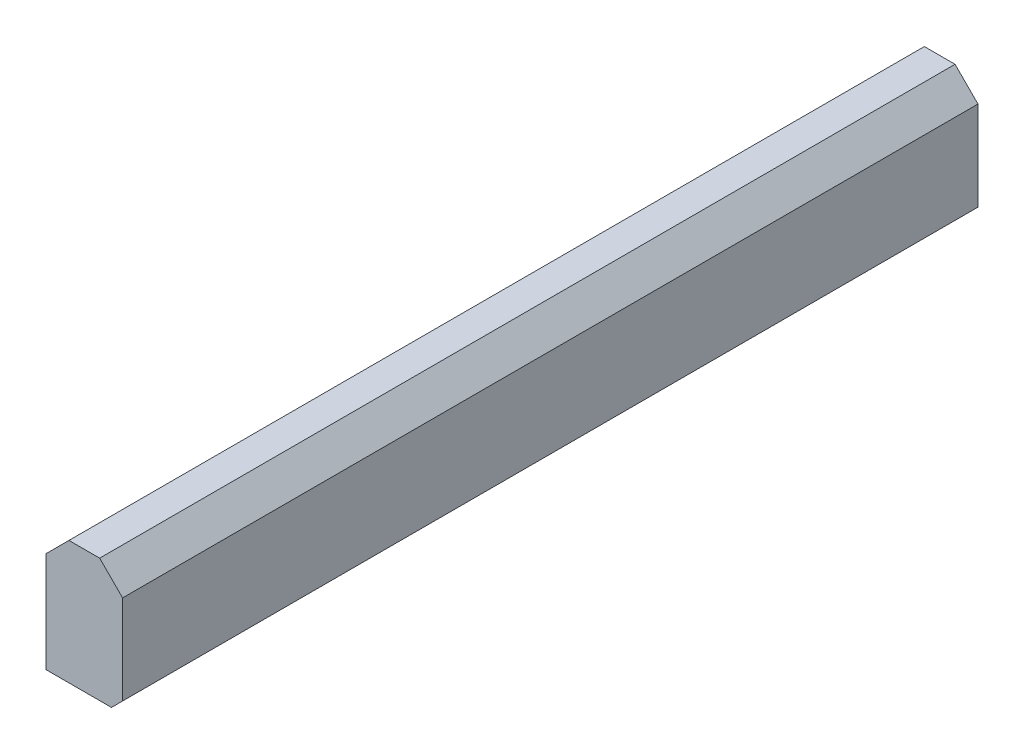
from build123d import *

# Parameters (mm, degrees)
SKETCH2_W           = 188.214
SKETCH2_H           = 116.84
BOSS_EXTRUDE1_DEPTH = 652.28397766
CHAMFER1_SIZE       = 17
CHAMFER2_SIZE       = 35


with BuildPart() as part:
    # Sketch2 → Boss-Extrude1 (new, symmetric)
    with BuildSketch(Plane(origin=(0, 0, 0), x_dir=(0, 1, 0), z_dir=(0, 0, 1))):
        Rectangle(SKETCH2_W, SKETCH2_H)
    extrude(amount=BOSS_EXTRUDE1_DEPTH, both=True)

    # Chamfer1
    chamfer1_edges = [part.edges().sort_by_distance(p)[0] for p in [
        (58.42, -94.107, 0),
    ]]
    chamfer(chamfer1_edges, length=CHAMFER1_SIZE)

    # Chamfer2
    chamfer2_edges = [part.edges().sort_by_distance(p)[0] for p in [
        (58.42, 94.107, 0),
        (-58.42, 94.107, 0),
    ]]
    chamfer(chamfer2_edges, length=CHAMFER2_SIZE)


solid = part.part
